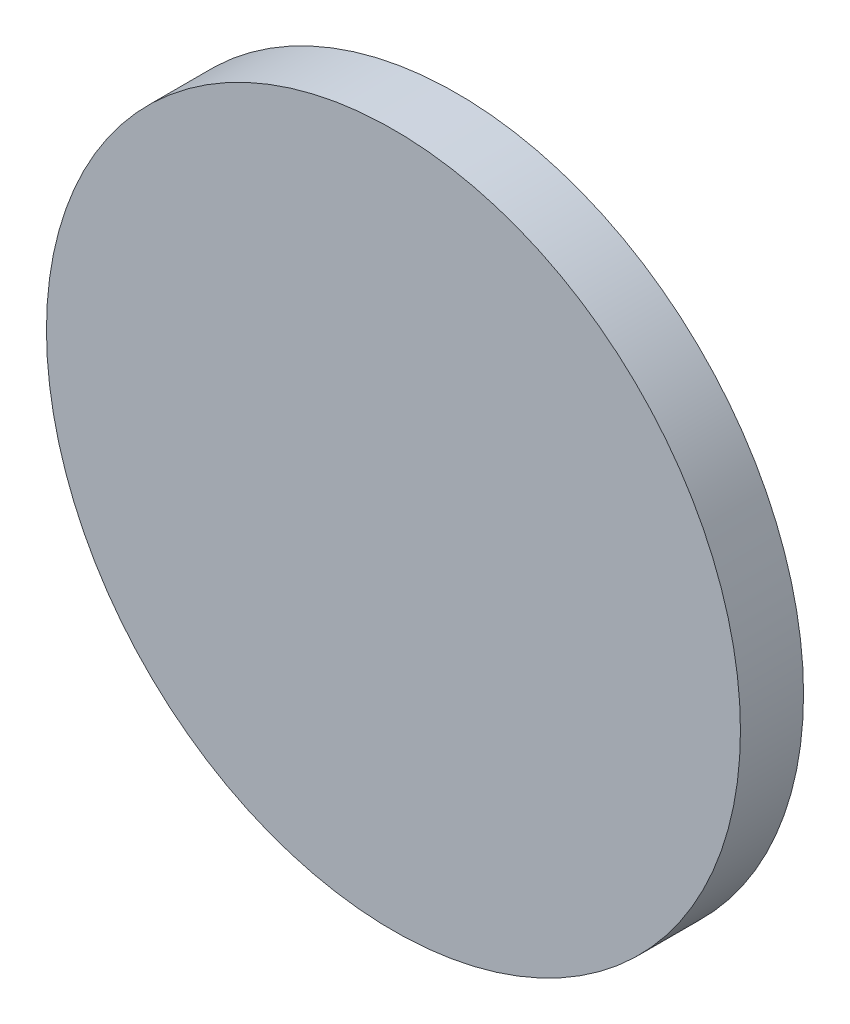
from build123d import *

# Parameters (mm, degrees)
SKETCH_1_R      = 16.5
EXTRUDE_1_DEPTH = 3


with BuildPart() as part:
    # Sketch 1 → Extrude 1 (new body)
    with BuildSketch(Plane.XY):
        Circle(SKETCH_1_R)
    extrude(amount=EXTRUDE_1_DEPTH)


solid = part.part
